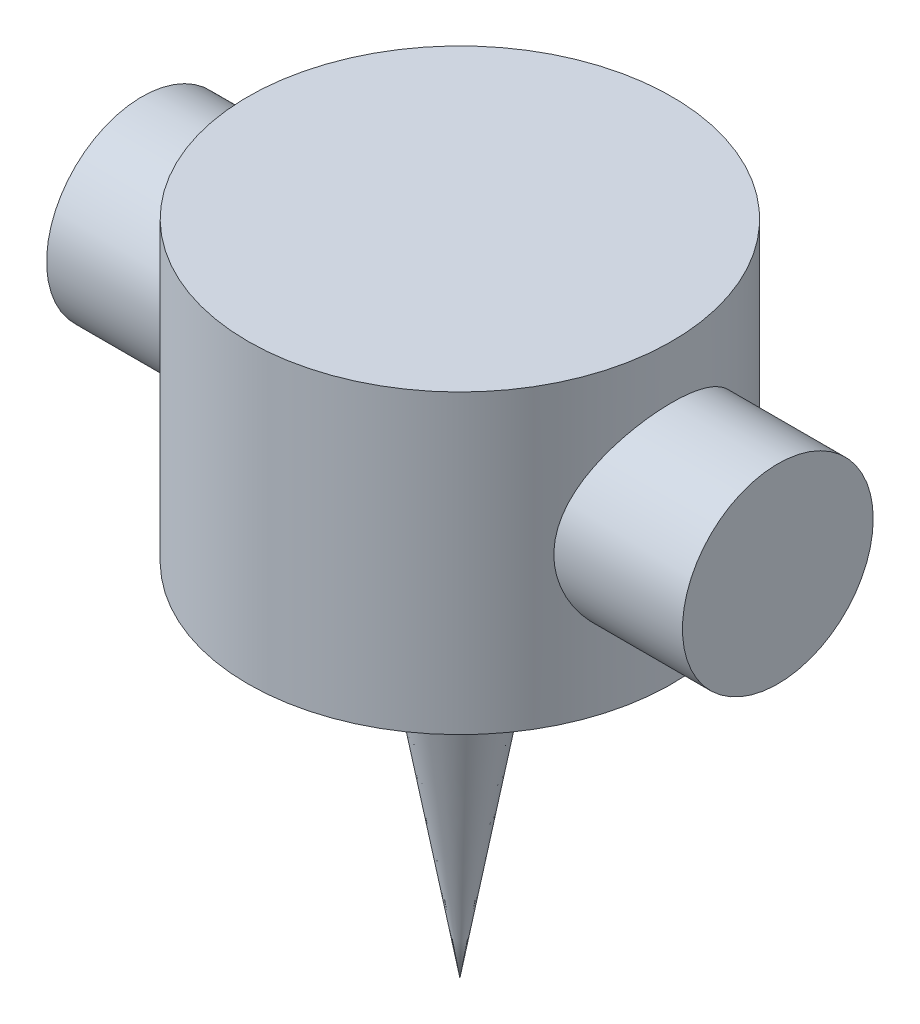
ISO-10303-21;
HEADER;
FILE_DESCRIPTION(('STEP AP214'),'2;1');
FILE_NAME('part.step','',(''),(''),'','','');
FILE_SCHEMA(('AUTOMOTIVE_DESIGN { 1 0 10303 214 1 1 1 1 }'));
ENDSEC;
DATA;
#1=APPLICATION_CONTEXT('core data for automotive mechanical design processes');
#2=APPLICATION_PROTOCOL_DEFINITION('international standard','automotive_design',2000,#1);
#3=PRODUCT_CONTEXT('',#1,'mechanical');
#4=PRODUCT('Part','Part','',(#3));
#5=PRODUCT_RELATED_PRODUCT_CATEGORY('part','',(#4));
#6=PRODUCT_DEFINITION_FORMATION('','',#4);
#7=PRODUCT_DEFINITION_CONTEXT('part definition',#1,'design');
#8=PRODUCT_DEFINITION('design','',#6,#7);
#9=PRODUCT_DEFINITION_SHAPE('','',#8);
#10=(LENGTH_UNIT() NAMED_UNIT(*) SI_UNIT(.MILLI.,.METRE.));
#11=(NAMED_UNIT(*) PLANE_ANGLE_UNIT() SI_UNIT($,.RADIAN.));
#12=(NAMED_UNIT(*) SI_UNIT($,.STERADIAN.) SOLID_ANGLE_UNIT());
#13=UNCERTAINTY_MEASURE_WITH_UNIT(LENGTH_MEASURE(1.E-05),#10,'distance_accuracy_value','');
#14=(GEOMETRIC_REPRESENTATION_CONTEXT(3) GLOBAL_UNCERTAINTY_ASSIGNED_CONTEXT((#13)) GLOBAL_UNIT_ASSIGNED_CONTEXT((#10,
#11,#12)) REPRESENTATION_CONTEXT('',''));
#15=CARTESIAN_POINT('',(0.,0.,0.));
#16=DIRECTION('',(0.,0.,1.));
#17=DIRECTION('',(1.,0.,0.));
#18=AXIS2_PLACEMENT_3D('',#15,#16,#17);
#19=CARTESIAN_POINT('',(0.,70.,0.));
#20=DIRECTION('',(0.,-1.,0.));
#21=DIRECTION('',(0.,0.,-1.));
#22=AXIS2_PLACEMENT_3D('',#19,#20,#21);
#23=CYLINDRICAL_SURFACE('',#22,50.);
#24=CARTESIAN_POINT('',(-44.6514277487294,35.,-22.5));
#25=CARTESIAN_POINT('',(-44.6514331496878,35.5951139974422,-22.4999952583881));
#26=CARTESIAN_POINT('',(-44.6633665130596,36.1903805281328,-22.4763557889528));
#27=CARTESIAN_POINT('',(-44.7106933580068,37.376491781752,-22.3820594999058));
#28=CARTESIAN_POINT('',(-44.7461005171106,37.9673337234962,-22.3113752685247));
#29=CARTESIAN_POINT('',(-44.8392259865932,39.1411630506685,-22.1236252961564));
#30=CARTESIAN_POINT('',(-44.8969934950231,39.7241301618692,-22.0064572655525));
#31=CARTESIAN_POINT('',(-45.0328466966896,40.8766319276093,-21.7270978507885));
#32=CARTESIAN_POINT('',(-45.1109296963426,41.4461683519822,-21.5649124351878));
#33=CARTESIAN_POINT('',(-45.28448938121,42.5656764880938,-21.1980179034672));
#34=CARTESIAN_POINT('',(-45.3798852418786,43.115725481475,-20.9935057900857));
#35=CARTESIAN_POINT('',(-45.5854408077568,44.1958470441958,-20.5433387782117));
#36=CARTESIAN_POINT('',(-45.6956009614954,44.7259190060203,-20.2976826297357));
#37=CARTESIAN_POINT('',(-45.9275507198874,45.7631493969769,-19.7672406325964));
#38=CARTESIAN_POINT('',(-46.0493357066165,46.2703168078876,-19.4824703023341));
#39=CARTESIAN_POINT('',(-46.3014323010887,47.2597565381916,-18.8755229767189));
#40=CARTESIAN_POINT('',(-46.431747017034,47.7420196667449,-18.5533323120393));
#41=CARTESIAN_POINT('',(-46.7064434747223,48.7102658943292,-17.8510362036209));
#42=CARTESIAN_POINT('',(-46.8511859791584,49.19439357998,-17.4685117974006));
#43=CARTESIAN_POINT('',(-47.1428419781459,50.1292707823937,-16.6653820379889));
#44=CARTESIAN_POINT('',(-47.2897555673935,50.5800188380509,-16.2447750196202));
#45=CARTESIAN_POINT('',(-47.5820862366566,51.4460075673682,-15.3674636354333));
#46=CARTESIAN_POINT('',(-47.7275023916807,51.8612273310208,-14.9107383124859));
#47=CARTESIAN_POINT('',(-48.0130575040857,52.6533320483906,-13.9639078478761));
#48=CARTESIAN_POINT('',(-48.1531982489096,53.0302300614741,-13.473814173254));
#49=CARTESIAN_POINT('',(-48.4318803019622,53.7621292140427,-12.4360940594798));
#50=CARTESIAN_POINT('',(-48.5699529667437,54.1149479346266,-11.8867985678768));
#51=CARTESIAN_POINT('',(-48.8325746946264,54.7727415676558,-10.7571323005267));
#52=CARTESIAN_POINT('',(-48.9571231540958,55.0777143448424,-10.1767601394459));
#53=CARTESIAN_POINT('',(-49.1890641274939,55.6368294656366,-8.98898854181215));
#54=CARTESIAN_POINT('',(-49.2964634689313,55.8909920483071,-8.38159998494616));
#55=CARTESIAN_POINT('',(-49.4909639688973,56.3459091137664,-7.14399759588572));
#56=CARTESIAN_POINT('',(-49.5780668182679,56.5466680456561,-6.51378567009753));
#57=CARTESIAN_POINT('',(-49.7247989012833,56.8821153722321,-5.2735939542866));
#58=CARTESIAN_POINT('',(-49.7857544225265,57.0200241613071,-4.66464137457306));
#59=CARTESIAN_POINT('',(-49.8856349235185,57.2449264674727,-3.43561453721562));
#60=CARTESIAN_POINT('',(-49.9245607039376,57.3319218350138,-2.81554068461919));
#61=CARTESIAN_POINT('',(-49.9792486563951,57.4539143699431,-1.56953348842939));
#62=CARTESIAN_POINT('',(-49.9950202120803,57.4889326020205,-0.943602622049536));
#63=CARTESIAN_POINT('',(-50.0029670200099,57.5065944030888,0.309134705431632));
#64=CARTESIAN_POINT('',(-49.9951433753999,57.4892404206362,0.935941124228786));
#65=CARTESIAN_POINT('',(-49.9575213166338,57.4054719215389,2.14086897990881));
#66=CARTESIAN_POINT('',(-49.9293196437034,57.3426216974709,2.71929238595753));
#67=CARTESIAN_POINT('',(-49.8534653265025,57.172591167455,3.86825826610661));
#68=CARTESIAN_POINT('',(-49.8058137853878,57.0654133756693,4.4388011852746));
#69=CARTESIAN_POINT('',(-49.6922279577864,56.807816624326,5.56818084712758));
#70=CARTESIAN_POINT('',(-49.6262930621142,56.6573962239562,6.12701719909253));
#71=CARTESIAN_POINT('',(-49.477718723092,56.3147476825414,7.22943622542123));
#72=CARTESIAN_POINT('',(-49.3950787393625,56.1225181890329,7.77301840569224));
#73=CARTESIAN_POINT('',(-49.2136507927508,55.6947216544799,8.84981312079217));
#74=CARTESIAN_POINT('',(-49.11463745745,55.4585430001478,9.38274438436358));
#75=CARTESIAN_POINT('',(-48.903670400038,54.9467620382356,10.4266302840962));
#76=CARTESIAN_POINT('',(-48.7917166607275,54.6711596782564,10.9375848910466));
#77=CARTESIAN_POINT('',(-48.5573562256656,54.0824464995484,11.9350627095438));
#78=CARTESIAN_POINT('',(-48.4349467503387,53.7693256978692,12.4215793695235));
#79=CARTESIAN_POINT('',(-48.1823883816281,53.1076243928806,13.3677702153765));
#80=CARTESIAN_POINT('',(-48.0522388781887,52.7590410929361,13.8274422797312));
#81=CARTESIAN_POINT('',(-47.7763874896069,51.9990713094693,14.753596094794));
#82=CARTESIAN_POINT('',(-47.6302756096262,51.5848898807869,15.2176650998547));
#83=CARTESIAN_POINT('',(-47.3360332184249,50.7199056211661,16.1096422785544));
#84=CARTESIAN_POINT('',(-47.1879026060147,50.2691009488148,16.5375486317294));
#85=CARTESIAN_POINT('',(-46.89341695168,49.3331741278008,17.3550067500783));
#86=CARTESIAN_POINT('',(-46.7470624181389,48.8480424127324,17.7445477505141));
#87=CARTESIAN_POINT('',(-46.4600368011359,47.8458397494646,18.4830198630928));
#88=CARTESIAN_POINT('',(-46.3193683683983,47.3287541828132,18.8319321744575));
#89=CARTESIAN_POINT('',(-46.0418201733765,46.2421950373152,19.5009661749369));
#90=CARTESIAN_POINT('',(-45.9053759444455,45.6714189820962,19.8191584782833));
#91=CARTESIAN_POINT('',(-45.6476770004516,44.5018679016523,20.4056907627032));
#92=CARTESIAN_POINT('',(-45.5264143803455,43.9031076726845,20.6740567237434));
#93=CARTESIAN_POINT('',(-45.3033650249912,42.6814884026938,21.1583610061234));
#94=CARTESIAN_POINT('',(-45.2015702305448,42.0586394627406,21.3743210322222));
#95=CARTESIAN_POINT('',(-45.0213292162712,40.7932703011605,21.7514069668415));
#96=CARTESIAN_POINT('',(-44.9428804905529,40.1507521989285,21.9125387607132));
#97=CARTESIAN_POINT('',(-44.817238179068,38.8980624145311,22.1683098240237));
#98=CARTESIAN_POINT('',(-44.7682054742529,38.2888788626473,22.2668913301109));
#99=CARTESIAN_POINT('',(-44.6948737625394,37.0629943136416,22.4137247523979));
#100=CARTESIAN_POINT('',(-44.6705735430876,36.4462936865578,22.4619791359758));
#101=CARTESIAN_POINT('',(-44.6476546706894,35.2107794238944,22.5075006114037));
#102=CARTESIAN_POINT('',(-44.6490259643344,34.591966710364,22.5047876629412));
#103=CARTESIAN_POINT('',(-44.6773734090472,33.3572712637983,22.4484588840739));
#104=CARTESIAN_POINT('',(-44.7043484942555,32.7413884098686,22.3948451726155));
#105=CARTESIAN_POINT('',(-44.7796955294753,31.5668196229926,22.2437696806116));
#106=CARTESIAN_POINT('',(-44.8261772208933,31.0075090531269,22.1501708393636));
#107=CARTESIAN_POINT('',(-44.9384237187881,29.899439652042,21.9215481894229));
#108=CARTESIAN_POINT('',(-45.0041872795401,29.3506801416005,21.7865270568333));
#109=CARTESIAN_POINT('',(-45.1530264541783,28.2669457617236,21.4763532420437));
#110=CARTESIAN_POINT('',(-45.2361053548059,27.7319735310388,21.3011929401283));
#111=CARTESIAN_POINT('',(-45.417202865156,26.6788542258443,20.9122848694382));
#112=CARTESIAN_POINT('',(-45.51522226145,26.1607080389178,20.6985350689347));
#113=CARTESIAN_POINT('',(-45.7282605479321,25.1210213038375,20.2236712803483));
#114=CARTESIAN_POINT('',(-45.8438447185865,24.6003708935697,19.9608628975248));
#115=CARTESIAN_POINT('',(-46.0853754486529,23.5826283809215,19.3967091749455));
#116=CARTESIAN_POINT('',(-46.211326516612,23.0855466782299,19.0953470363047));
#117=CARTESIAN_POINT('',(-46.4703652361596,22.1173569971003,18.4560046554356));
#118=CARTESIAN_POINT('',(-46.6034541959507,21.6462538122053,18.1180176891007));
#119=CARTESIAN_POINT('',(-46.8735498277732,20.7321915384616,17.4073214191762));
#120=CARTESIAN_POINT('',(-47.0105567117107,20.2892339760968,17.03461023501));
#121=CARTESIAN_POINT('',(-47.2988026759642,19.3915172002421,16.2181543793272));
#122=CARTESIAN_POINT('',(-47.4501211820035,18.9398527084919,15.7710278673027));
#123=CARTESIAN_POINT('',(-47.7496171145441,18.075451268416,14.8395884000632));
#124=CARTESIAN_POINT('',(-47.8977943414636,17.6627167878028,14.355273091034));
#125=CARTESIAN_POINT('',(-48.187103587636,16.8787495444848,13.3519893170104));
#126=CARTESIAN_POINT('',(-48.3282342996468,16.5075244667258,12.8330144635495));
#127=CARTESIAN_POINT('',(-48.5996615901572,15.809362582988,11.7633876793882));
#128=CARTESIAN_POINT('',(-48.7299583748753,15.4824249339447,11.212736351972));
#129=CARTESIAN_POINT('',(-48.9774286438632,14.8724809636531,10.0773212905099));
#130=CARTESIAN_POINT('',(-49.0944567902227,14.5899500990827,9.49226992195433));
#131=CARTESIAN_POINT('',(-49.310523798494,14.0755581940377,8.29704696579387));
#132=CARTESIAN_POINT('',(-49.40956232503,13.8436980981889,7.68687491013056));
#133=CARTESIAN_POINT('',(-49.5866720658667,13.4333054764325,6.44626262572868));
#134=CARTESIAN_POINT('',(-49.6647553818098,13.2547421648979,5.81583433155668));
#135=CARTESIAN_POINT('',(-49.7976369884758,12.9529354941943,4.53947850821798));
#136=CARTESIAN_POINT('',(-49.8524373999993,12.8296870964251,3.89355239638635));
#137=CARTESIAN_POINT('',(-49.9336934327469,12.6476000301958,2.64332248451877));
#138=CARTESIAN_POINT('',(-49.9620484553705,12.5844372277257,2.03976842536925));
#139=CARTESIAN_POINT('',(-49.9967964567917,12.5070927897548,0.828911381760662));
#140=CARTESIAN_POINT('',(-50.0031906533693,12.4929084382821,0.221608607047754));
#141=CARTESIAN_POINT('',(-49.9938429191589,12.5136840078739,-0.99185317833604));
#142=CARTESIAN_POINT('',(-49.978105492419,12.5486339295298,-1.59801239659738));
#143=CARTESIAN_POINT('',(-49.9249336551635,12.667248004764,-2.80457423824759));
#144=CARTESIAN_POINT('',(-49.8874995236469,12.7509115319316,-3.40497693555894));
#145=CARTESIAN_POINT('',(-49.7941697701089,12.9609950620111,-4.5678246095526));
#146=CARTESIAN_POINT('',(-49.7392113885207,13.0852509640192,-5.13073815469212));
#147=CARTESIAN_POINT('',(-49.6118161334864,13.3759540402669,-6.2435016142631));
#148=CARTESIAN_POINT('',(-49.5393799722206,13.5423994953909,-6.79335205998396));
#149=CARTESIAN_POINT('',(-49.3787128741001,13.915984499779,-7.87671636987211));
#150=CARTESIAN_POINT('',(-49.2904802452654,14.1231284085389,-8.41022847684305));
#151=CARTESIAN_POINT('',(-49.1002233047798,14.5763807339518,-9.45788432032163));
#152=CARTESIAN_POINT('',(-48.9981983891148,14.8224908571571,-9.97202720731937));
#153=CARTESIAN_POINT('',(-48.7776616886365,15.3639569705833,-11.0013306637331));
#154=CARTESIAN_POINT('',(-48.658609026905,15.6610513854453,-11.5154607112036));
#155=CARTESIAN_POINT('',(-48.4106550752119,16.2936856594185,-12.516975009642));
#156=CARTESIAN_POINT('',(-48.2817535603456,16.629226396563,-13.004358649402));
#157=CARTESIAN_POINT('',(-48.0170393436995,17.3366576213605,-13.9500934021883));
#158=CARTESIAN_POINT('',(-47.8812256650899,17.7085532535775,-14.4084403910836));
#159=CARTESIAN_POINT('',(-47.6057351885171,18.4867178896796,-15.2940899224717));
#160=CARTESIAN_POINT('',(-47.4660566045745,18.8930029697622,-15.7213777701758));
#161=CARTESIAN_POINT('',(-47.1747494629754,19.7719812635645,-16.5759760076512));
#162=CARTESIAN_POINT('',(-47.0230696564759,20.2473879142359,-17.0004830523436));
#163=CARTESIAN_POINT('',(-46.7232457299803,21.2329408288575,-17.8079692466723));
#164=CARTESIAN_POINT('',(-46.575100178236,21.7430726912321,-18.1909654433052));
#165=CARTESIAN_POINT('',(-46.2863958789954,22.7960268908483,-18.9135160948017));
#166=CARTESIAN_POINT('',(-46.1458443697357,23.3388794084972,-19.2530295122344));
#167=CARTESIAN_POINT('',(-45.8767837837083,24.4538224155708,-19.8856458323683));
#168=CARTESIAN_POINT('',(-45.7482739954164,25.0259111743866,-20.17875147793));
#169=CARTESIAN_POINT('',(-45.5067720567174,26.1995464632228,-20.7176612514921));
#170=CARTESIAN_POINT('',(-45.3938796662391,26.8012518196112,-20.9631649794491));
#171=CARTESIAN_POINT('',(-45.1885910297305,28.0269322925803,-21.4021038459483));
#172=CARTESIAN_POINT('',(-45.0961982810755,28.6509111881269,-21.5955301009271));
#173=CARTESIAN_POINT('',(-44.935755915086,29.9143706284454,-21.9274204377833));
#174=CARTESIAN_POINT('',(-44.8676345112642,30.5537993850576,-22.0660467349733));
#175=CARTESIAN_POINT('',(-44.7581999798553,31.8442134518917,-22.2871920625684));
#176=CARTESIAN_POINT('',(-44.7168668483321,32.495189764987,-22.3697529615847));
#177=CARTESIAN_POINT('',(-44.6770338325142,33.4565677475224,-22.4491263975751));
#178=CARTESIAN_POINT('',(-44.6674421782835,33.7648439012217,-22.4681953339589));
#179=CARTESIAN_POINT('',(-44.6546376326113,34.3820663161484,-22.4936335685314));
#180=CARTESIAN_POINT('',(-44.6514249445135,34.6910125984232,-22.5000024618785));
#181=CARTESIAN_POINT('',(-44.6514277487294,35.,-22.5));
#182=B_SPLINE_CURVE_WITH_KNOTS('',3,(#24,#25,#26,#27,#28,#29,#30,#31,#32,#33,#34,#35,#36,#37,
#38,#39,#40,#41,#42,#43,#44,#45,#46,#47,#48,#49,#50,#51,#52,#53,#54,#55,#56,#57,#58,#59,#60,#61,
#62,#63,#64,#65,#66,#67,#68,#69,#70,#71,#72,#73,#74,#75,#76,#77,#78,#79,#80,#81,#82,#83,#84,#85,
#86,#87,#88,#89,#90,#91,#92,#93,#94,#95,#96,#97,#98,#99,#100,#101,#102,#103,#104,#105,#106,#107,
#108,#109,#110,#111,#112,#113,#114,#115,#116,#117,#118,#119,#120,#121,#122,#123,#124,#125,#126,
#127,#128,#129,#130,#131,#132,#133,#134,#135,#136,#137,#138,#139,#140,#141,#142,#143,#144,#145,
#146,#147,#148,#149,#150,#151,#152,#153,#154,#155,#156,#157,#158,#159,#160,#161,#162,#163,#164,
#165,#166,#167,#168,#169,#170,#171,#172,#173,#174,#175,#176,#177,#178,#179,#180,#181),
.UNSPECIFIED.,.T.,.F.,(4,2,2,2,2,2,2,2,2,2,2,2,2,2,2,2,2,2,2,2,2,2,2,2,2,2,2,2,2,2,2,2,2,2,2,2,
2,2,2,2,2,2,2,2,2,2,2,2,2,2,2,2,2,2,2,2,2,2,2,2,2,2,2,2,2,2,2,2,2,2,2,2,2,2,2,2,2,2,4),(0.,
1.78502228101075,3.5710855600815,5.36110114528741,7.15087951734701,8.93250779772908,
10.7141902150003,12.4951677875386,14.2767979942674,16.1760215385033,18.0753281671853,
19.9757450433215,21.8755121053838,23.87483164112,25.8742403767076,27.8728511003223,
29.8712952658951,31.7508351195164,33.6303066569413,35.5090162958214,37.3876381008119,
39.1331142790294,40.8784914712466,42.6239268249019,44.3694186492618,46.141316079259,
47.9132158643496,49.6855881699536,51.4581003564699,53.3728276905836,55.287651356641,
57.2030107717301,59.1192530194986,61.1193940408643,63.1184892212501,65.1167550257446,
67.1148062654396,68.9694551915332,70.8240131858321,72.6778449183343,74.5315994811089,
76.2366306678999,77.9415517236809,79.6467966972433,81.3521314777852,83.1339549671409,
84.9165575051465,86.6994878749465,88.4825148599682,90.4402100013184,92.3980291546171,
94.3562101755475,96.3143539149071,98.2922128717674,100.270108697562,102.246859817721,
104.223430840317,106.04363457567,107.863737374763,109.683469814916,111.503178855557,
113.238450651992,114.973651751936,116.709038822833,118.44450191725,120.259398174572,
122.074335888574,123.889530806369,125.70557901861,127.668772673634,129.631157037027,
131.59537998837,133.55948680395,135.535611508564,137.512073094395,139.482639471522,
141.451732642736,142.378499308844,143.305295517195),.UNSPECIFIED.);
#183=CARTESIAN_POINT('',(-44.6514277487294,35.,-22.5));
#184=VERTEX_POINT('',#183);
#185=EDGE_CURVE('E67',#184,#184,#182,.T.);
#186=ORIENTED_EDGE('',*,*,#185,.T.);
#187=EDGE_LOOP('',(#186));
#188=FACE_BOUND('',#187,.T.);
#189=CARTESIAN_POINT('',(44.6514277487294,35.,-22.5));
#190=CARTESIAN_POINT('',(44.6514331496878,34.4048860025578,-22.4999952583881));
#191=CARTESIAN_POINT('',(44.6633665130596,33.8096194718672,-22.4763557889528));
#192=CARTESIAN_POINT('',(44.7106933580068,32.623508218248,-22.3820594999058));
#193=CARTESIAN_POINT('',(44.7461005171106,32.0326662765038,-22.3113752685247));
#194=CARTESIAN_POINT('',(44.8392259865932,30.8588369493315,-22.1236252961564));
#195=CARTESIAN_POINT('',(44.8969934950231,30.2758698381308,-22.0064572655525));
#196=CARTESIAN_POINT('',(45.0328466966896,29.1233680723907,-21.7270978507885));
#197=CARTESIAN_POINT('',(45.1109296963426,28.5538316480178,-21.5649124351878));
#198=CARTESIAN_POINT('',(45.28448938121,27.4343235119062,-21.1980179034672));
#199=CARTESIAN_POINT('',(45.3798852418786,26.8842745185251,-20.9935057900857));
#200=CARTESIAN_POINT('',(45.5854408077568,25.8041529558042,-20.5433387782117));
#201=CARTESIAN_POINT('',(45.6956009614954,25.2740809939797,-20.2976826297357));
#202=CARTESIAN_POINT('',(45.9275507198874,24.2368506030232,-19.7672406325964));
#203=CARTESIAN_POINT('',(46.0493357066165,23.7296831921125,-19.4824703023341));
#204=CARTESIAN_POINT('',(46.3014323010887,22.7402434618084,-18.8755229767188));
#205=CARTESIAN_POINT('',(46.431747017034,22.2579803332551,-18.5533323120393));
#206=CARTESIAN_POINT('',(46.7064434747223,21.2897341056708,-17.8510362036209));
#207=CARTESIAN_POINT('',(46.8511859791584,20.8056064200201,-17.4685117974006));
#208=CARTESIAN_POINT('',(47.1428419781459,19.8707292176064,-16.6653820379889));
#209=CARTESIAN_POINT('',(47.2897555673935,19.4199811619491,-16.2447750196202));
#210=CARTESIAN_POINT('',(47.5820862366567,18.5539924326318,-15.3674636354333));
#211=CARTESIAN_POINT('',(47.7275023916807,18.1387726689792,-14.9107383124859));
#212=CARTESIAN_POINT('',(48.0130575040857,17.3466679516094,-13.9639078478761));
#213=CARTESIAN_POINT('',(48.1531982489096,16.9697699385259,-13.473814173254));
#214=CARTESIAN_POINT('',(48.4318803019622,16.2378707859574,-12.4360940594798));
#215=CARTESIAN_POINT('',(48.5699529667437,15.8850520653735,-11.8867985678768));
#216=CARTESIAN_POINT('',(48.8325746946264,15.2272584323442,-10.7571323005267));
#217=CARTESIAN_POINT('',(48.9571231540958,14.9222856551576,-10.1767601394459));
#218=CARTESIAN_POINT('',(49.1890641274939,14.3631705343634,-8.98898854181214));
#219=CARTESIAN_POINT('',(49.2964634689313,14.1090079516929,-8.38159998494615));
#220=CARTESIAN_POINT('',(49.4909639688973,13.6540908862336,-7.14399759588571));
#221=CARTESIAN_POINT('',(49.5780668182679,13.4533319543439,-6.51378567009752));
#222=CARTESIAN_POINT('',(49.7247989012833,13.1178846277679,-5.2735939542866));
#223=CARTESIAN_POINT('',(49.7857544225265,12.9799758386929,-4.66464137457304));
#224=CARTESIAN_POINT('',(49.8856349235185,12.7550735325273,-3.43561453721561));
#225=CARTESIAN_POINT('',(49.9245607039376,12.6680781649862,-2.81554068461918));
#226=CARTESIAN_POINT('',(49.9792486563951,12.546085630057,-1.56953348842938));
#227=CARTESIAN_POINT('',(49.9950202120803,12.5110673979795,-0.943602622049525));
#228=CARTESIAN_POINT('',(50.0029670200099,12.4934055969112,0.309134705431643));
#229=CARTESIAN_POINT('',(49.9951433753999,12.5107595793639,0.935941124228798));
#230=CARTESIAN_POINT('',(49.9575213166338,12.5945280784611,2.14086897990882));
#231=CARTESIAN_POINT('',(49.9293196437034,12.6573783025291,2.71929238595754));
#232=CARTESIAN_POINT('',(49.8534653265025,12.8274088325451,3.86825826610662));
#233=CARTESIAN_POINT('',(49.8058137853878,12.9345866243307,4.43880118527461));
#234=CARTESIAN_POINT('',(49.6922279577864,13.192183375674,5.56818084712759));
#235=CARTESIAN_POINT('',(49.6262930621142,13.3426037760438,6.12701719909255));
#236=CARTESIAN_POINT('',(49.477718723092,13.6852523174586,7.22943622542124));
#237=CARTESIAN_POINT('',(49.3950787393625,13.8774818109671,7.77301840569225));
#238=CARTESIAN_POINT('',(49.2136507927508,14.3052783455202,8.84981312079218));
#239=CARTESIAN_POINT('',(49.11463745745,14.5414569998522,9.38274438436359));
#240=CARTESIAN_POINT('',(48.903670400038,15.0532379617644,10.4266302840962));
#241=CARTESIAN_POINT('',(48.7917166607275,15.3288403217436,10.9375848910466));
#242=CARTESIAN_POINT('',(48.5573562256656,15.9175535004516,11.9350627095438));
#243=CARTESIAN_POINT('',(48.4349467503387,16.2306743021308,12.4215793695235));
#244=CARTESIAN_POINT('',(48.1823883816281,16.8923756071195,13.3677702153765));
#245=CARTESIAN_POINT('',(48.0522388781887,17.240958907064,13.8274422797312));
#246=CARTESIAN_POINT('',(47.7763874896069,18.0009286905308,14.753596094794));
#247=CARTESIAN_POINT('',(47.6302756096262,18.4151101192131,15.2176650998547));
#248=CARTESIAN_POINT('',(47.3360332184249,19.2800943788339,16.1096422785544));
#249=CARTESIAN_POINT('',(47.1879026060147,19.7308990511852,16.5375486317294));
#250=CARTESIAN_POINT('',(46.89341695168,20.6668258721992,17.3550067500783));
#251=CARTESIAN_POINT('',(46.7470624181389,21.1519575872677,17.744547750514));
#252=CARTESIAN_POINT('',(46.4600368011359,22.1541602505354,18.4830198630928));
#253=CARTESIAN_POINT('',(46.3193683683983,22.6712458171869,18.8319321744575));
#254=CARTESIAN_POINT('',(46.0418201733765,23.7578049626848,19.5009661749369));
#255=CARTESIAN_POINT('',(45.9053759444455,24.3285810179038,19.8191584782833));
#256=CARTESIAN_POINT('',(45.6476770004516,25.4981320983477,20.4056907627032));
#257=CARTESIAN_POINT('',(45.5264143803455,26.0968923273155,20.6740567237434));
#258=CARTESIAN_POINT('',(45.3033650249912,27.3185115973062,21.1583610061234));
#259=CARTESIAN_POINT('',(45.2015702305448,27.9413605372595,21.3743210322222));
#260=CARTESIAN_POINT('',(45.0213292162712,29.2067296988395,21.7514069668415));
#261=CARTESIAN_POINT('',(44.9428804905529,29.8492478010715,21.9125387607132));
#262=CARTESIAN_POINT('',(44.817238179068,31.101937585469,22.1683098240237));
#263=CARTESIAN_POINT('',(44.7682054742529,31.7111211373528,22.2668913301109));
#264=CARTESIAN_POINT('',(44.6948737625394,32.9370056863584,22.4137247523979));
#265=CARTESIAN_POINT('',(44.6705735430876,33.5537063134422,22.4619791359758));
#266=CARTESIAN_POINT('',(44.6476546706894,34.7892205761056,22.5075006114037));
#267=CARTESIAN_POINT('',(44.6490259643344,35.408033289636,22.5047876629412));
#268=CARTESIAN_POINT('',(44.6773734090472,36.6427287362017,22.4484588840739));
#269=CARTESIAN_POINT('',(44.7043484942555,37.2586115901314,22.3948451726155));
#270=CARTESIAN_POINT('',(44.7796955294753,38.4331803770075,22.2437696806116));
#271=CARTESIAN_POINT('',(44.8261772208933,38.9924909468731,22.1501708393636));
#272=CARTESIAN_POINT('',(44.938423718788,40.100560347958,21.9215481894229));
#273=CARTESIAN_POINT('',(45.0041872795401,40.6493198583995,21.7865270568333));
#274=CARTESIAN_POINT('',(45.1530264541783,41.7330542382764,21.4763532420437));
#275=CARTESIAN_POINT('',(45.2361053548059,42.2680264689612,21.3011929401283));
#276=CARTESIAN_POINT('',(45.417202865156,43.3211457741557,20.9122848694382));
#277=CARTESIAN_POINT('',(45.51522226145,43.8392919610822,20.6985350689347));
#278=CARTESIAN_POINT('',(45.7282605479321,44.8789786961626,20.2236712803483));
#279=CARTESIAN_POINT('',(45.8438447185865,45.3996291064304,19.9608628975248));
#280=CARTESIAN_POINT('',(46.0853754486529,46.4173716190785,19.3967091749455));
#281=CARTESIAN_POINT('',(46.211326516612,46.9144533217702,19.0953470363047));
#282=CARTESIAN_POINT('',(46.4703652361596,47.8826430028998,18.4560046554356));
#283=CARTESIAN_POINT('',(46.6034541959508,48.3537461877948,18.1180176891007));
#284=CARTESIAN_POINT('',(46.8735498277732,49.2678084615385,17.4073214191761));
#285=CARTESIAN_POINT('',(47.0105567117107,49.7107660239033,17.03461023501));
#286=CARTESIAN_POINT('',(47.2988026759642,50.608482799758,16.2181543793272));
#287=CARTESIAN_POINT('',(47.4501211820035,51.0601472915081,15.7710278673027));
#288=CARTESIAN_POINT('',(47.7496171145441,51.924548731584,14.8395884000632));
#289=CARTESIAN_POINT('',(47.8977943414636,52.3372832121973,14.355273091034));
#290=CARTESIAN_POINT('',(48.187103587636,53.1212504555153,13.3519893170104));
#291=CARTESIAN_POINT('',(48.3282342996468,53.4924755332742,12.8330144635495));
#292=CARTESIAN_POINT('',(48.5996615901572,54.190637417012,11.7633876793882));
#293=CARTESIAN_POINT('',(48.7299583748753,54.5175750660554,11.212736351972));
#294=CARTESIAN_POINT('',(48.9774286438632,55.1275190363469,10.0773212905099));
#295=CARTESIAN_POINT('',(49.0944567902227,55.4100499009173,9.49226992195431));
#296=CARTESIAN_POINT('',(49.310523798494,55.9244418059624,8.29704696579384));
#297=CARTESIAN_POINT('',(49.40956232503,56.1563019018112,7.68687491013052));
#298=CARTESIAN_POINT('',(49.5866720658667,56.5666945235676,6.44626262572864));
#299=CARTESIAN_POINT('',(49.6647553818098,56.7452578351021,5.81583433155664));
#300=CARTESIAN_POINT('',(49.7976369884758,57.0470645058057,4.53947850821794));
#301=CARTESIAN_POINT('',(49.8524373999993,57.170312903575,3.89355239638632));
#302=CARTESIAN_POINT('',(49.9336934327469,57.3523999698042,2.64332248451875));
#303=CARTESIAN_POINT('',(49.9620484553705,57.4155627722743,2.03976842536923));
#304=CARTESIAN_POINT('',(49.9967964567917,57.4929072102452,0.828911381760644));
#305=CARTESIAN_POINT('',(50.0031906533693,57.507091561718,0.221608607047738));
#306=CARTESIAN_POINT('',(49.9938429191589,57.4863159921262,-0.991853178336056));
#307=CARTESIAN_POINT('',(49.978105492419,57.4513660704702,-1.5980123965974));
#308=CARTESIAN_POINT('',(49.9249336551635,57.332751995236,-2.80457423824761));
#309=CARTESIAN_POINT('',(49.8874995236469,57.2490884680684,-3.40497693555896));
#310=CARTESIAN_POINT('',(49.7941697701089,57.039004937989,-4.56782460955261));
#311=CARTESIAN_POINT('',(49.7392113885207,56.9147490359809,-5.13073815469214));
#312=CARTESIAN_POINT('',(49.6118161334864,56.6240459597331,-6.24350161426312));
#313=CARTESIAN_POINT('',(49.5393799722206,56.4576005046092,-6.79335205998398));
#314=CARTESIAN_POINT('',(49.3787128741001,56.0840155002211,-7.87671636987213));
#315=CARTESIAN_POINT('',(49.2904802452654,55.8768715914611,-8.41022847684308));
#316=CARTESIAN_POINT('',(49.1002233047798,55.4236192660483,-9.45788432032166));
#317=CARTESIAN_POINT('',(48.9981983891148,55.1775091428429,-9.97202720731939));
#318=CARTESIAN_POINT('',(48.7776616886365,54.6360430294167,-11.0013306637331));
#319=CARTESIAN_POINT('',(48.658609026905,54.3389486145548,-11.5154607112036));
#320=CARTESIAN_POINT('',(48.4106550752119,53.7063143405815,-12.516975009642));
#321=CARTESIAN_POINT('',(48.2817535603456,53.370773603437,-13.0043586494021));
#322=CARTESIAN_POINT('',(48.0170393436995,52.6633423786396,-13.9500934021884));
#323=CARTESIAN_POINT('',(47.8812256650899,52.2914467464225,-14.4084403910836));
#324=CARTESIAN_POINT('',(47.6057351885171,51.5132821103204,-15.2940899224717));
#325=CARTESIAN_POINT('',(47.4660566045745,51.1069970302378,-15.7213777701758));
#326=CARTESIAN_POINT('',(47.1747494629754,50.2280187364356,-16.5759760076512));
#327=CARTESIAN_POINT('',(47.0230696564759,49.7526120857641,-17.0004830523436));
#328=CARTESIAN_POINT('',(46.7232457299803,48.7670591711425,-17.8079692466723));
#329=CARTESIAN_POINT('',(46.575100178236,48.2569273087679,-18.1909654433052));
#330=CARTESIAN_POINT('',(46.2863958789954,47.2039731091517,-18.9135160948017));
#331=CARTESIAN_POINT('',(46.1458443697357,46.6611205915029,-19.2530295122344));
#332=CARTESIAN_POINT('',(45.8767837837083,45.5461775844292,-19.8856458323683));
#333=CARTESIAN_POINT('',(45.7482739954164,44.9740888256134,-20.17875147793));
#334=CARTESIAN_POINT('',(45.5067720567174,43.8004535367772,-20.7176612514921));
#335=CARTESIAN_POINT('',(45.3938796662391,43.1987481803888,-20.9631649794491));
#336=CARTESIAN_POINT('',(45.1885910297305,41.9730677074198,-21.4021038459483));
#337=CARTESIAN_POINT('',(45.0961982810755,41.3490888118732,-21.5955301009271));
#338=CARTESIAN_POINT('',(44.935755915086,40.0856293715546,-21.9274204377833));
#339=CARTESIAN_POINT('',(44.8676345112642,39.4462006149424,-22.0660467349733));
#340=CARTESIAN_POINT('',(44.7581999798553,38.1557865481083,-22.2871920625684));
#341=CARTESIAN_POINT('',(44.7168668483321,37.504810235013,-22.3697529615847));
#342=CARTESIAN_POINT('',(44.6770338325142,36.5434322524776,-22.4491263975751));
#343=CARTESIAN_POINT('',(44.6674421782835,36.2351560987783,-22.4681953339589));
#344=CARTESIAN_POINT('',(44.6546376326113,35.6179336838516,-22.4936335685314));
#345=CARTESIAN_POINT('',(44.6514249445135,35.3089874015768,-22.5000024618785));
#346=CARTESIAN_POINT('',(44.6514277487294,35.,-22.5));
#347=B_SPLINE_CURVE_WITH_KNOTS('',3,(#189,#190,#191,#192,#193,#194,#195,#196,#197,#198,#199,
#200,#201,#202,#203,#204,#205,#206,#207,#208,#209,#210,#211,#212,#213,#214,#215,#216,#217,#218,
#219,#220,#221,#222,#223,#224,#225,#226,#227,#228,#229,#230,#231,#232,#233,#234,#235,#236,#237,
#238,#239,#240,#241,#242,#243,#244,#245,#246,#247,#248,#249,#250,#251,#252,#253,#254,#255,#256,
#257,#258,#259,#260,#261,#262,#263,#264,#265,#266,#267,#268,#269,#270,#271,#272,#273,#274,#275,
#276,#277,#278,#279,#280,#281,#282,#283,#284,#285,#286,#287,#288,#289,#290,#291,#292,#293,#294,
#295,#296,#297,#298,#299,#300,#301,#302,#303,#304,#305,#306,#307,#308,#309,#310,#311,#312,#313,
#314,#315,#316,#317,#318,#319,#320,#321,#322,#323,#324,#325,#326,#327,#328,#329,#330,#331,#332,
#333,#334,#335,#336,#337,#338,#339,#340,#341,#342,#343,#344,#345,#346),.UNSPECIFIED.,.T.,.F.,(4,
2,2,2,2,2,2,2,2,2,2,2,2,2,2,2,2,2,2,2,2,2,2,2,2,2,2,2,2,2,2,2,2,2,2,2,2,2,2,2,2,2,2,2,2,2,2,2,2,
2,2,2,2,2,2,2,2,2,2,2,2,2,2,2,2,2,2,2,2,2,2,2,2,2,2,2,2,2,4),(0.,1.78502228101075,
3.5710855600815,5.36110114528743,7.15087951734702,8.93250779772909,10.7141902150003,
12.4951677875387,14.2767979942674,16.1760215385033,18.0753281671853,19.9757450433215,
21.8755121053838,23.87483164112,25.8742403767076,27.8728511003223,29.8712952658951,
31.7508351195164,33.6303066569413,35.5090162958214,37.3876381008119,39.1331142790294,
40.8784914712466,42.6239268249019,44.3694186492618,46.141316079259,47.9132158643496,
49.6855881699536,51.4581003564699,53.3728276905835,55.287651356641,57.2030107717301,
59.1192530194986,61.1193940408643,63.1184892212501,65.1167550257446,67.1148062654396,
68.9694551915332,70.8240131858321,72.6778449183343,74.5315994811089,76.2366306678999,
77.9415517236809,79.6467966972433,81.3521314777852,83.133954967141,84.9165575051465,
86.6994878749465,88.4825148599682,90.4402100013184,92.3980291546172,94.3562101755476,
96.3143539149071,98.2922128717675,100.270108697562,102.246859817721,104.223430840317,
106.04363457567,107.863737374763,109.683469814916,111.503178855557,113.238450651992,
114.973651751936,116.709038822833,118.44450191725,120.259398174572,122.074335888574,
123.889530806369,125.70557901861,127.668772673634,129.631157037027,131.59537998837,
133.55948680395,135.535611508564,137.512073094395,139.482639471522,141.451732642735,
142.378499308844,143.305295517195),.UNSPECIFIED.);
#348=CARTESIAN_POINT('',(44.6514277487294,35.,-22.5));
#349=VERTEX_POINT('',#348);
#350=EDGE_CURVE('E74',#349,#349,#347,.T.);
#351=ORIENTED_EDGE('',*,*,#350,.T.);
#352=EDGE_LOOP('',(#351));
#353=FACE_BOUND('',#352,.T.);
#354=CARTESIAN_POINT('',(0.,70.,0.));
#355=DIRECTION('',(0.,1.,0.));
#356=DIRECTION('',(0.,0.,1.));
#357=AXIS2_PLACEMENT_3D('',#354,#355,#356);
#358=CIRCLE('',#357,50.);
#359=CARTESIAN_POINT('',(0.,70.,50.));
#360=VERTEX_POINT('',#359);
#361=EDGE_CURVE('E47',#360,#360,#358,.T.);
#362=ORIENTED_EDGE('',*,*,#361,.F.);
#363=EDGE_LOOP('',(#362));
#364=FACE_BOUND('',#363,.T.);
#365=CARTESIAN_POINT('',(0.,0.,0.));
#366=DIRECTION('',(0.,1.,0.));
#367=DIRECTION('',(0.,0.,1.));
#368=AXIS2_PLACEMENT_3D('',#365,#366,#367);
#369=CIRCLE('',#368,50.);
#370=CARTESIAN_POINT('',(0.,0.,50.));
#371=VERTEX_POINT('',#370);
#372=EDGE_CURVE('E64',#371,#371,#369,.T.);
#373=ORIENTED_EDGE('',*,*,#372,.T.);
#374=EDGE_LOOP('',(#373));
#375=FACE_BOUND('',#374,.T.);
#376=ADVANCED_FACE('F39',(#188,#353,#364,#375),#23,.T.);
#377=CARTESIAN_POINT('',(0.,70.,0.));
#378=DIRECTION('',(0.,1.,0.));
#379=DIRECTION('',(0.,0.,1.));
#380=AXIS2_PLACEMENT_3D('',#377,#378,#379);
#381=PLANE('',#380);
#382=ORIENTED_EDGE('',*,*,#361,.T.);
#383=EDGE_LOOP('',(#382));
#384=FACE_BOUND('',#383,.T.);
#385=ADVANCED_FACE('F61',(#384),#381,.T.);
#386=CARTESIAN_POINT('',(0.,0.,0.));
#387=DIRECTION('',(0.,1.,0.));
#388=DIRECTION('',(0.,0.,1.));
#389=AXIS2_PLACEMENT_3D('',#386,#387,#388);
#390=PLANE('',#389);
#391=CARTESIAN_POINT('',(0.,0.,0.));
#392=DIRECTION('',(0.,1.,0.));
#393=DIRECTION('',(0.,0.,1.));
#394=AXIS2_PLACEMENT_3D('',#391,#392,#393);
#395=CIRCLE('',#394,15.);
#396=CARTESIAN_POINT('',(0.,0.,15.));
#397=VERTEX_POINT('',#396);
#398=EDGE_CURVE('E11',#397,#397,#395,.F.);
#399=ORIENTED_EDGE('',*,*,#398,.F.);
#400=EDGE_LOOP('',(#399));
#401=FACE_BOUND('',#400,.T.);
#402=ORIENTED_EDGE('',*,*,#372,.F.);
#403=EDGE_LOOP('',(#402));
#404=FACE_BOUND('',#403,.T.);
#405=ADVANCED_FACE('F57',(#401,#404),#390,.F.);
#406=CARTESIAN_POINT('',(75.,35.,0.));
#407=DIRECTION('',(1.,0.,0.));
#408=DIRECTION('',(0.,0.,-1.));
#409=AXIS2_PLACEMENT_3D('',#406,#407,#408);
#410=PLANE('',#409);
#411=CARTESIAN_POINT('',(75.,35.,0.));
#412=DIRECTION('',(1.,0.,0.));
#413=DIRECTION('',(0.,0.,-1.));
#414=AXIS2_PLACEMENT_3D('',#411,#412,#413);
#415=CIRCLE('',#414,22.5);
#416=CARTESIAN_POINT('',(75.,35.,-22.5));
#417=VERTEX_POINT('',#416);
#418=EDGE_CURVE('E120',#417,#417,#415,.T.);
#419=ORIENTED_EDGE('',*,*,#418,.T.);
#420=EDGE_LOOP('',(#419));
#421=FACE_BOUND('',#420,.T.);
#422=ADVANCED_FACE('F60',(#421),#410,.T.);
#423=CARTESIAN_POINT('',(-75.,35.,0.));
#424=DIRECTION('',(1.,0.,0.));
#425=DIRECTION('',(0.,0.,-1.));
#426=AXIS2_PLACEMENT_3D('',#423,#424,#425);
#427=CYLINDRICAL_SURFACE('',#426,22.5);
#428=ORIENTED_EDGE('',*,*,#418,.F.);
#429=EDGE_LOOP('',(#428));
#430=FACE_BOUND('',#429,.T.);
#431=ORIENTED_EDGE('',*,*,#350,.F.);
#432=EDGE_LOOP('',(#431));
#433=FACE_BOUND('',#432,.T.);
#434=ADVANCED_FACE('F92',(#430,#433),#427,.T.);
#435=CARTESIAN_POINT('',(-75.,35.,0.));
#436=DIRECTION('',(1.,0.,0.));
#437=DIRECTION('',(0.,0.,-1.));
#438=AXIS2_PLACEMENT_3D('',#435,#436,#437);
#439=CIRCLE('',#438,22.5);
#440=CARTESIAN_POINT('',(-75.,35.,-22.5));
#441=VERTEX_POINT('',#440);
#442=EDGE_CURVE('E83',#441,#441,#439,.T.);
#443=ORIENTED_EDGE('',*,*,#442,.T.);
#444=EDGE_LOOP('',(#443));
#445=FACE_BOUND('',#444,.T.);
#446=ORIENTED_EDGE('',*,*,#185,.F.);
#447=EDGE_LOOP('',(#446));
#448=FACE_BOUND('',#447,.T.);
#449=ADVANCED_FACE('F87',(#445,#448),#427,.T.);
#450=CARTESIAN_POINT('',(-75.,35.,0.));
#451=DIRECTION('',(1.,0.,0.));
#452=DIRECTION('',(0.,0.,-1.));
#453=AXIS2_PLACEMENT_3D('',#450,#451,#452);
#454=PLANE('',#453);
#455=ORIENTED_EDGE('',*,*,#442,.F.);
#456=EDGE_LOOP('',(#455));
#457=FACE_BOUND('',#456,.T.);
#458=ADVANCED_FACE('F53',(#457),#454,.F.);
#459=CARTESIAN_POINT('',(0.,0.,0.));
#460=DIRECTION('',(0.,1.,0.));
#461=DIRECTION('',(0.,0.,-1.));
#462=AXIS2_PLACEMENT_3D('',#459,#460,#461);
#463=CONICAL_SURFACE('',#462,15.,0.174532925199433);
#464=CARTESIAN_POINT('',(0.,-85.0692272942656,0.));
#465=VERTEX_POINT('',#464);
#466=VERTEX_LOOP('',#465);
#467=FACE_BOUND('',#466,.T.);
#468=ORIENTED_EDGE('',*,*,#398,.T.);
#469=EDGE_LOOP('',(#468));
#470=FACE_BOUND('',#469,.T.);
#471=ADVANCED_FACE('F50',(#467,#470),#463,.T.);
#472=CLOSED_SHELL('',(#376,#385,#405,#422,#434,#449,#458,#471));
#473=MANIFOLD_SOLID_BREP('B2',#472);
#474=ADVANCED_BREP_SHAPE_REPRESENTATION('',(#18,#473),#14);
#475=SHAPE_DEFINITION_REPRESENTATION(#9,#474);
ENDSEC;
END-ISO-10303-21;
